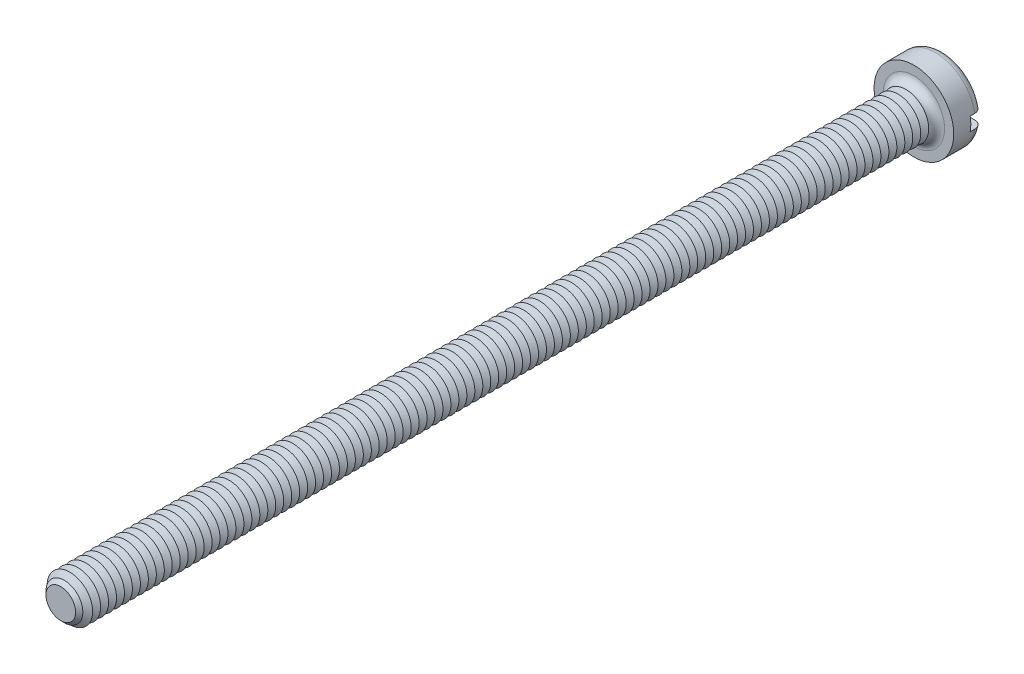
from build123d import *

# Parameters (mm, degrees)
SKETCH3_R           = 3.5
BOSS_EXTRUDE2_DEPTH = 2.6
SKETCH4_R           = 2
BOSS_EXTRUDE3_DEPTH = 75
FILLET1_R           = 0.7
CHAMFER1_SIZE       = 0.7
LPATTERN1_COUNT     = 106
LPATTERN1_PITCH     = 0.7
SKETCH8_W           = 7
SKETCH8_H           = 1.2
CUT_EXTRUDE1_DEPTH  = 1.1


with BuildPart() as part:
    # Sketch3 → Boss-Extrude2 (new body)
    with BuildSketch(Plane.XY):
        Circle(SKETCH3_R)
    extrude(amount=-BOSS_EXTRUDE2_DEPTH)

    # Sketch4 → Boss-Extrude3 (add)
    with BuildSketch(Plane.XY):
        Circle(SKETCH4_R)
    extrude(amount=BOSS_EXTRUDE3_DEPTH)

    # Fillet1
    fillet1_edges = [part.edges().sort_by_distance(p)[0] for p in [
        (-3.5, 0, -2.6),
        (-2, 0, 0),
    ]]
    fillet(fillet1_edges, radius=FILLET1_R)

    # Chamfer1
    chamfer1_edges = [part.edges().sort_by_distance(p)[0] for p in [
        (-2, 0, 75),
    ]]
    chamfer(chamfer1_edges, length=CHAMFER1_SIZE)

    # Sketch6 → Cut-Revolve1 (revolve, cut)
    with BuildSketch(Plane(origin=(0, 0, 0), x_dir=(0, 0, -1), z_dir=(1, 0, 0)), mode=Mode.PRIVATE) as cut_revolve1_sk:
        Polygon((-0.7, 2), (-1.05, 1.393782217), (-1.4, 2), align=None)
    cut_revolve1 = revolve(cut_revolve1_sk.sketch.rotate(Axis((0, 0, -1.694361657), (0, 0, 1)), 90), axis=Axis((0, 0, -1.694361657), (0, 0, 1)), mode=Mode.SUBTRACT)

    # LPattern1: Cut-Revolve1 ×106
    with Locations(*[(0, 0, i * LPATTERN1_PITCH) for i in range(1, LPATTERN1_COUNT)]):
        add(cut_revolve1, mode=Mode.SUBTRACT)

    # Sketch8 → Cut-Extrude1 (cut)
    with BuildSketch(Plane(origin=(0, 0, -2.6), x_dir=(-1, 0, 0), z_dir=(0, 0, -1))):
        Rectangle(SKETCH8_W, SKETCH8_H)
    extrude(amount=-CUT_EXTRUDE1_DEPTH, mode=Mode.SUBTRACT)


solid = part.part
